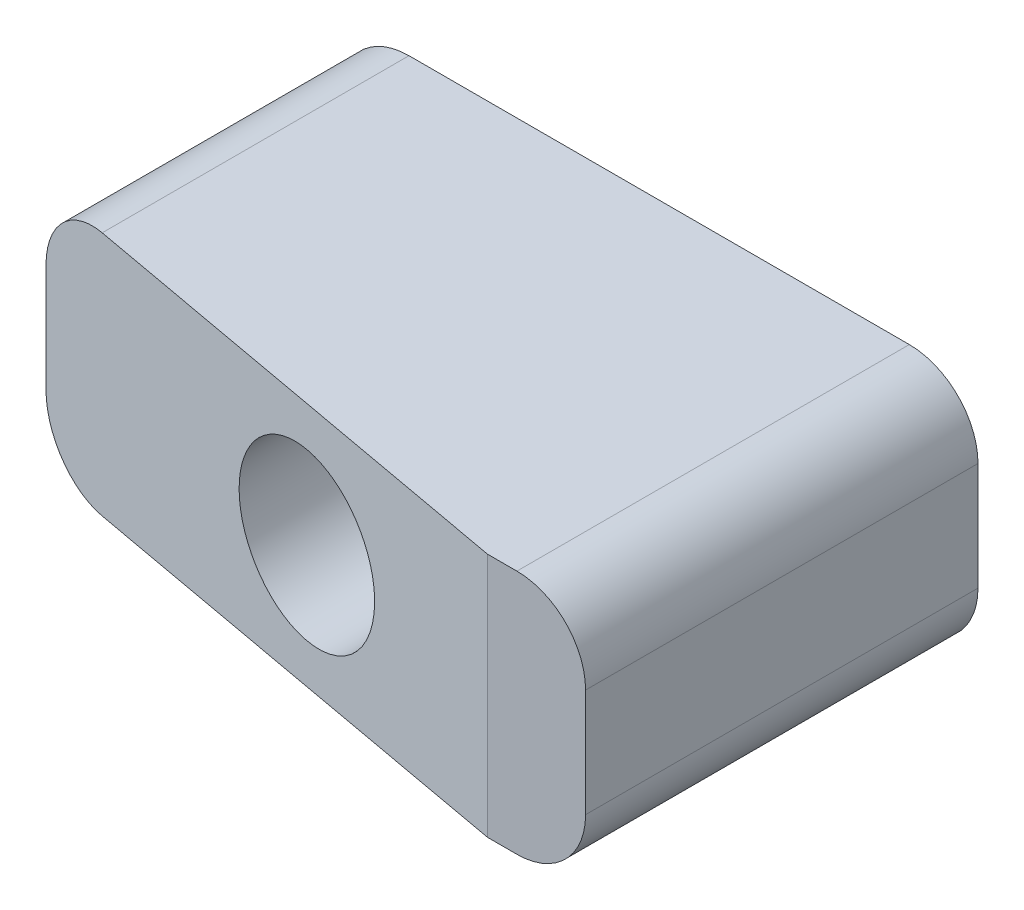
ISO-10303-21;
HEADER;
FILE_DESCRIPTION(('STEP AP214'),'2;1');
FILE_NAME('part.step','',(''),(''),'','','');
FILE_SCHEMA(('AUTOMOTIVE_DESIGN { 1 0 10303 214 1 1 1 1 }'));
ENDSEC;
DATA;
#1=APPLICATION_CONTEXT('core data for automotive mechanical design processes');
#2=APPLICATION_PROTOCOL_DEFINITION('international standard','automotive_design',2000,#1);
#3=PRODUCT_CONTEXT('',#1,'mechanical');
#4=PRODUCT('Part','Part','',(#3));
#5=PRODUCT_RELATED_PRODUCT_CATEGORY('part','',(#4));
#6=PRODUCT_DEFINITION_FORMATION('','',#4);
#7=PRODUCT_DEFINITION_CONTEXT('part definition',#1,'design');
#8=PRODUCT_DEFINITION('design','',#6,#7);
#9=PRODUCT_DEFINITION_SHAPE('','',#8);
#10=(LENGTH_UNIT() NAMED_UNIT(*) SI_UNIT(.MILLI.,.METRE.));
#11=(NAMED_UNIT(*) PLANE_ANGLE_UNIT() SI_UNIT($,.RADIAN.));
#12=(NAMED_UNIT(*) SI_UNIT($,.STERADIAN.) SOLID_ANGLE_UNIT());
#13=UNCERTAINTY_MEASURE_WITH_UNIT(LENGTH_MEASURE(1.E-05),#10,'distance_accuracy_value','');
#14=(GEOMETRIC_REPRESENTATION_CONTEXT(3) GLOBAL_UNCERTAINTY_ASSIGNED_CONTEXT((#13)) GLOBAL_UNIT_ASSIGNED_CONTEXT((#10,
#11,#12)) REPRESENTATION_CONTEXT('',''));
#15=CARTESIAN_POINT('',(0.,0.,0.));
#16=DIRECTION('',(0.,0.,1.));
#17=DIRECTION('',(1.,0.,0.));
#18=AXIS2_PLACEMENT_3D('',#15,#16,#17);
#19=CARTESIAN_POINT('',(-1103.249,76.835,-31.75));
#20=DIRECTION('',(-1.,0.,0.));
#21=DIRECTION('',(0.,0.,1.));
#22=AXIS2_PLACEMENT_3D('',#19,#20,#21);
#23=PLANE('',#22);
#24=DIRECTION('',(0.,0.,1.));
#25=VECTOR('',#24,1.);
#26=CARTESIAN_POINT('',(-1103.249,69.85,-31.75));
#27=LINE('',#26,#25);
#28=CARTESIAN_POINT('',(-1103.249,69.85,-25.4));
#29=VERTEX_POINT('',#28);
#30=CARTESIAN_POINT('',(-1103.249,69.85,-6.34999999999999));
#31=VERTEX_POINT('',#30);
#32=EDGE_CURVE('E190',#29,#31,#27,.T.);
#33=ORIENTED_EDGE('',*,*,#32,.T.);
#34=DIRECTION('',(0.,1.,0.));
#35=VECTOR('',#34,1.);
#36=CARTESIAN_POINT('',(-1103.249,-22.4886369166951,-6.35));
#37=LINE('',#36,#35);
#38=CARTESIAN_POINT('',(-1103.249,76.835,-6.34999999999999));
#39=VERTEX_POINT('',#38);
#40=EDGE_CURVE('E69',#31,#39,#37,.T.);
#41=ORIENTED_EDGE('',*,*,#40,.T.);
#42=DIRECTION('',(0.,0.,1.));
#43=VECTOR('',#42,1.);
#44=CARTESIAN_POINT('',(-1103.249,76.835,-31.75));
#45=LINE('',#44,#43);
#46=CARTESIAN_POINT('',(-1103.249,76.835,-25.4));
#47=VERTEX_POINT('',#46);
#48=EDGE_CURVE('E193',#47,#39,#45,.T.);
#49=ORIENTED_EDGE('',*,*,#48,.F.);
#50=DIRECTION('',(0.,-1.,0.));
#51=VECTOR('',#50,1.);
#52=CARTESIAN_POINT('',(-1103.249,76.835,-25.4));
#53=LINE('',#52,#51);
#54=EDGE_CURVE('E381',#47,#29,#53,.T.);
#55=ORIENTED_EDGE('',*,*,#54,.T.);
#56=EDGE_LOOP('',(#33,#41,#49,#55));
#57=FACE_BOUND('',#56,.T.);
#58=ADVANCED_FACE('F49',(#57),#23,.T.);
#59=CARTESIAN_POINT('',(-1098.804,76.835,-31.75));
#60=DIRECTION('',(0.,0.,1.));
#61=DIRECTION('',(1.,0.,0.));
#62=AXIS2_PLACEMENT_3D('',#59,#60,#61);
#63=CYLINDRICAL_SURFACE('',#62,4.44500000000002);
#64=CARTESIAN_POINT('',(-1098.804,76.835,-5.54181818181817));
#65=DIRECTION('',(0.178885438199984,0.,-0.983869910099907));
#66=DIRECTION('',(0.983869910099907,0.,0.178885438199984));
#67=AXIS2_PLACEMENT_3D('',#64,#65,#66);
#68=ELLIPSE('',#67,4.51787370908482,4.44500000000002);
#69=CARTESIAN_POINT('',(-1098.804,81.28,-5.54181818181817));
#70=VERTEX_POINT('',#69);
#71=EDGE_CURVE('E126',#70,#39,#68,.F.);
#72=ORIENTED_EDGE('',*,*,#71,.F.);
#73=DIRECTION('',(0.,0.,1.));
#74=VECTOR('',#73,1.);
#75=CARTESIAN_POINT('',(-1098.804,81.28,-31.75));
#76=LINE('',#75,#74);
#77=CARTESIAN_POINT('',(-1098.804,81.28,-25.4));
#78=VERTEX_POINT('',#77);
#79=EDGE_CURVE('E60',#78,#70,#76,.T.);
#80=ORIENTED_EDGE('',*,*,#79,.F.);
#81=CARTESIAN_POINT('',(-1098.804,76.835,-25.4));
#82=DIRECTION('',(0.,0.,1.));
#83=DIRECTION('',(1.,0.,0.));
#84=AXIS2_PLACEMENT_3D('',#81,#82,#83);
#85=CIRCLE('',#84,4.44500000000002);
#86=EDGE_CURVE('E139',#78,#47,#85,.T.);
#87=ORIENTED_EDGE('',*,*,#86,.T.);
#88=ORIENTED_EDGE('',*,*,#48,.T.);
#89=EDGE_LOOP('',(#72,#80,#87,#88));
#90=FACE_BOUND('',#89,.T.);
#91=ADVANCED_FACE('F259',(#90),#63,.T.);
#92=CARTESIAN_POINT('',(-1066.419,81.28,-31.75));
#93=DIRECTION('',(0.,1.,0.));
#94=DIRECTION('',(0.,0.,1.));
#95=AXIS2_PLACEMENT_3D('',#92,#93,#94);
#96=PLANE('',#95);
#97=DIRECTION('',(-0.983869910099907,0.,-0.178885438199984));
#98=VECTOR('',#97,1.);
#99=CARTESIAN_POINT('',(-1072.06796,81.28,-0.680719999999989));
#100=LINE('',#99,#98);
#101=CARTESIAN_POINT('',(-1068.324,81.28,0.));
#102=VERTEX_POINT('',#101);
#103=EDGE_CURVE('E118',#102,#70,#100,.T.);
#104=ORIENTED_EDGE('',*,*,#103,.F.);
#105=DIRECTION('',(-1.,0.,0.));
#106=VECTOR('',#105,1.);
#107=CARTESIAN_POINT('',(-1066.419,81.28,0.));
#108=LINE('',#107,#106);
#109=CARTESIAN_POINT('',(-1066.419,81.28,0.));
#110=VERTEX_POINT('',#109);
#111=EDGE_CURVE('E121',#110,#102,#108,.T.);
#112=ORIENTED_EDGE('',*,*,#111,.F.);
#113=DIRECTION('',(0.,0.,1.));
#114=VECTOR('',#113,1.);
#115=CARTESIAN_POINT('',(-1066.419,81.28,-31.75));
#116=LINE('',#115,#114);
#117=CARTESIAN_POINT('',(-1066.419,81.28,-25.4));
#118=VERTEX_POINT('',#117);
#119=EDGE_CURVE('E99',#118,#110,#116,.T.);
#120=ORIENTED_EDGE('',*,*,#119,.F.);
#121=DIRECTION('',(-1.,0.,0.));
#122=VECTOR('',#121,1.);
#123=CARTESIAN_POINT('',(-1098.804,81.28,-25.4));
#124=LINE('',#123,#122);
#125=EDGE_CURVE('E53',#118,#78,#124,.T.);
#126=ORIENTED_EDGE('',*,*,#125,.T.);
#127=ORIENTED_EDGE('',*,*,#79,.T.);
#128=EDGE_LOOP('',(#104,#112,#120,#126,#127));
#129=FACE_BOUND('',#128,.T.);
#130=ADVANCED_FACE('F120',(#129),#96,.T.);
#131=CARTESIAN_POINT('',(-1066.419,76.835,-31.75));
#132=DIRECTION('',(0.,0.,1.));
#133=DIRECTION('',(1.,0.,0.));
#134=AXIS2_PLACEMENT_3D('',#131,#132,#133);
#135=CYLINDRICAL_SURFACE('',#134,4.44500000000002);
#136=CARTESIAN_POINT('',(-1066.419,76.835,0.));
#137=DIRECTION('',(0.,0.,1.));
#138=DIRECTION('',(-1.,0.,0.));
#139=AXIS2_PLACEMENT_3D('',#136,#137,#138);
#140=CIRCLE('',#139,4.44500000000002);
#141=CARTESIAN_POINT('',(-1061.974,76.835,0.));
#142=VERTEX_POINT('',#141);
#143=EDGE_CURVE('E137',#142,#110,#140,.T.);
#144=ORIENTED_EDGE('',*,*,#143,.F.);
#145=DIRECTION('',(0.,0.,1.));
#146=VECTOR('',#145,1.);
#147=CARTESIAN_POINT('',(-1061.974,76.835,-31.75));
#148=LINE('',#147,#146);
#149=CARTESIAN_POINT('',(-1061.974,76.835,-25.4));
#150=VERTEX_POINT('',#149);
#151=EDGE_CURVE('E175',#150,#142,#148,.T.);
#152=ORIENTED_EDGE('',*,*,#151,.F.);
#153=CARTESIAN_POINT('',(-1066.419,76.835,-25.4));
#154=DIRECTION('',(0.,0.,1.));
#155=DIRECTION('',(1.,0.,0.));
#156=AXIS2_PLACEMENT_3D('',#153,#154,#155);
#157=CIRCLE('',#156,4.44500000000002);
#158=EDGE_CURVE('E384',#150,#118,#157,.T.);
#159=ORIENTED_EDGE('',*,*,#158,.T.);
#160=ORIENTED_EDGE('',*,*,#119,.T.);
#161=EDGE_LOOP('',(#144,#152,#159,#160));
#162=FACE_BOUND('',#161,.T.);
#163=ADVANCED_FACE('F279',(#162),#135,.T.);
#164=CARTESIAN_POINT('',(-1061.974,76.835,-31.75));
#165=DIRECTION('',(1.,0.,0.));
#166=DIRECTION('',(0.,0.,-1.));
#167=AXIS2_PLACEMENT_3D('',#164,#165,#166);
#168=PLANE('',#167);
#169=DIRECTION('',(0.,1.,0.));
#170=VECTOR('',#169,1.);
#171=CARTESIAN_POINT('',(-1061.974,76.835,0.));
#172=LINE('',#171,#170);
#173=CARTESIAN_POINT('',(-1061.974,69.85,0.));
#174=VERTEX_POINT('',#173);
#175=EDGE_CURVE('E166',#174,#142,#172,.T.);
#176=ORIENTED_EDGE('',*,*,#175,.F.);
#177=DIRECTION('',(0.,0.,1.));
#178=VECTOR('',#177,1.);
#179=CARTESIAN_POINT('',(-1061.974,69.85,-31.75));
#180=LINE('',#179,#178);
#181=CARTESIAN_POINT('',(-1061.974,69.85,-25.4));
#182=VERTEX_POINT('',#181);
#183=EDGE_CURVE('E179',#182,#174,#180,.T.);
#184=ORIENTED_EDGE('',*,*,#183,.F.);
#185=DIRECTION('',(0.,1.,0.));
#186=VECTOR('',#185,1.);
#187=CARTESIAN_POINT('',(-1061.974,76.835,-25.4));
#188=LINE('',#187,#186);
#189=EDGE_CURVE('E387',#182,#150,#188,.T.);
#190=ORIENTED_EDGE('',*,*,#189,.T.);
#191=ORIENTED_EDGE('',*,*,#151,.T.);
#192=EDGE_LOOP('',(#176,#184,#190,#191));
#193=FACE_BOUND('',#192,.T.);
#194=ADVANCED_FACE('F275',(#193),#168,.T.);
#195=CARTESIAN_POINT('',(-1066.419,69.85,-31.75));
#196=DIRECTION('',(0.,0.,1.));
#197=DIRECTION('',(1.,0.,0.));
#198=AXIS2_PLACEMENT_3D('',#195,#196,#197);
#199=CYLINDRICAL_SURFACE('',#198,4.44500000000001);
#200=CARTESIAN_POINT('',(-1066.419,69.85,0.));
#201=DIRECTION('',(0.,0.,1.));
#202=DIRECTION('',(-1.,0.,0.));
#203=AXIS2_PLACEMENT_3D('',#200,#201,#202);
#204=CIRCLE('',#203,4.44500000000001);
#205=CARTESIAN_POINT('',(-1066.419,65.405,0.));
#206=VERTEX_POINT('',#205);
#207=EDGE_CURVE('E162',#206,#174,#204,.T.);
#208=ORIENTED_EDGE('',*,*,#207,.F.);
#209=DIRECTION('',(0.,0.,1.));
#210=VECTOR('',#209,1.);
#211=CARTESIAN_POINT('',(-1066.419,65.405,-31.75));
#212=LINE('',#211,#210);
#213=CARTESIAN_POINT('',(-1066.419,65.405,-25.4));
#214=VERTEX_POINT('',#213);
#215=EDGE_CURVE('E183',#214,#206,#212,.T.);
#216=ORIENTED_EDGE('',*,*,#215,.F.);
#217=CARTESIAN_POINT('',(-1066.419,69.85,-25.4));
#218=DIRECTION('',(0.,0.,1.));
#219=DIRECTION('',(1.,0.,0.));
#220=AXIS2_PLACEMENT_3D('',#217,#218,#219);
#221=CIRCLE('',#220,4.44500000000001);
#222=EDGE_CURVE('E391',#214,#182,#221,.T.);
#223=ORIENTED_EDGE('',*,*,#222,.T.);
#224=ORIENTED_EDGE('',*,*,#183,.T.);
#225=EDGE_LOOP('',(#208,#216,#223,#224));
#226=FACE_BOUND('',#225,.T.);
#227=ADVANCED_FACE('F271',(#226),#199,.T.);
#228=CARTESIAN_POINT('',(-1066.419,65.405,-31.75));
#229=DIRECTION('',(0.,-1.,0.));
#230=DIRECTION('',(1.,0.,0.));
#231=AXIS2_PLACEMENT_3D('',#228,#229,#230);
#232=PLANE('',#231);
#233=DIRECTION('',(0.983869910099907,0.,0.178885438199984));
#234=VECTOR('',#233,1.);
#235=CARTESIAN_POINT('',(-1072.06796,65.405,-0.680719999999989));
#236=LINE('',#235,#234);
#237=CARTESIAN_POINT('',(-1098.804,65.405,-5.54181818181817));
#238=VERTEX_POINT('',#237);
#239=CARTESIAN_POINT('',(-1068.324,65.405,0.));
#240=VERTEX_POINT('',#239);
#241=EDGE_CURVE('E127',#238,#240,#236,.T.);
#242=ORIENTED_EDGE('',*,*,#241,.F.);
#243=DIRECTION('',(0.,0.,1.));
#244=VECTOR('',#243,1.);
#245=CARTESIAN_POINT('',(-1098.804,65.405,-31.75));
#246=LINE('',#245,#244);
#247=CARTESIAN_POINT('',(-1098.804,65.405,-25.4));
#248=VERTEX_POINT('',#247);
#249=EDGE_CURVE('E187',#248,#238,#246,.T.);
#250=ORIENTED_EDGE('',*,*,#249,.F.);
#251=DIRECTION('',(1.,0.,0.));
#252=VECTOR('',#251,1.);
#253=CARTESIAN_POINT('',(-1098.804,65.405,-25.4));
#254=LINE('',#253,#252);
#255=EDGE_CURVE('E397',#248,#214,#254,.T.);
#256=ORIENTED_EDGE('',*,*,#255,.T.);
#257=ORIENTED_EDGE('',*,*,#215,.T.);
#258=DIRECTION('',(1.,0.,0.));
#259=VECTOR('',#258,1.);
#260=CARTESIAN_POINT('',(-1066.419,65.405,0.));
#261=LINE('',#260,#259);
#262=EDGE_CURVE('E159',#240,#206,#261,.T.);
#263=ORIENTED_EDGE('',*,*,#262,.F.);
#264=EDGE_LOOP('',(#242,#250,#256,#257,#263));
#265=FACE_BOUND('',#264,.T.);
#266=ADVANCED_FACE('F268',(#265),#232,.T.);
#267=CARTESIAN_POINT('',(-1098.804,69.85,-31.75));
#268=DIRECTION('',(0.,0.,1.));
#269=DIRECTION('',(1.,0.,0.));
#270=AXIS2_PLACEMENT_3D('',#267,#268,#269);
#271=CYLINDRICAL_SURFACE('',#270,4.44500000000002);
#272=CARTESIAN_POINT('',(-1098.804,69.85,-5.54181818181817));
#273=DIRECTION('',(0.178885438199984,0.,-0.983869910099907));
#274=DIRECTION('',(0.983869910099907,0.,0.178885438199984));
#275=AXIS2_PLACEMENT_3D('',#272,#273,#274);
#276=ELLIPSE('',#275,4.51787370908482,4.44500000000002);
#277=EDGE_CURVE('E13',#31,#238,#276,.F.);
#278=ORIENTED_EDGE('',*,*,#277,.F.);
#279=ORIENTED_EDGE('',*,*,#32,.F.);
#280=CARTESIAN_POINT('',(-1098.804,69.85,-25.4));
#281=DIRECTION('',(0.,0.,1.));
#282=DIRECTION('',(1.,0.,0.));
#283=AXIS2_PLACEMENT_3D('',#280,#281,#282);
#284=CIRCLE('',#283,4.44500000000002);
#285=EDGE_CURVE('E401',#29,#248,#284,.T.);
#286=ORIENTED_EDGE('',*,*,#285,.T.);
#287=ORIENTED_EDGE('',*,*,#249,.T.);
#288=EDGE_LOOP('',(#278,#279,#286,#287));
#289=FACE_BOUND('',#288,.T.);
#290=ADVANCED_FACE('F265',(#289),#271,.T.);
#291=CARTESIAN_POINT('',(-1098.804,76.835,-25.4));
#292=DIRECTION('',(0.,0.,1.));
#293=DIRECTION('',(1.,0.,0.));
#294=AXIS2_PLACEMENT_3D('',#291,#292,#293);
#295=PLANE('',#294);
#296=CARTESIAN_POINT('',(-1082.6115,73.3425,-25.4));
#297=DIRECTION('',(0.,0.,1.));
#298=DIRECTION('',(1.,0.,0.));
#299=AXIS2_PLACEMENT_3D('',#296,#297,#298);
#300=CIRCLE('',#299,3.56869999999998);
#301=CARTESIAN_POINT('',(-1079.0428,73.3425,-25.4));
#302=VERTEX_POINT('',#301);
#303=EDGE_CURVE('E152',#302,#302,#300,.T.);
#304=ORIENTED_EDGE('',*,*,#303,.T.);
#305=EDGE_LOOP('',(#304));
#306=FACE_BOUND('',#305,.T.);
#307=ORIENTED_EDGE('',*,*,#86,.F.);
#308=ORIENTED_EDGE('',*,*,#125,.F.);
#309=ORIENTED_EDGE('',*,*,#158,.F.);
#310=ORIENTED_EDGE('',*,*,#189,.F.);
#311=ORIENTED_EDGE('',*,*,#222,.F.);
#312=ORIENTED_EDGE('',*,*,#255,.F.);
#313=ORIENTED_EDGE('',*,*,#285,.F.);
#314=ORIENTED_EDGE('',*,*,#54,.F.);
#315=EDGE_LOOP('',(#307,#308,#309,#310,#311,#312,#313,#314));
#316=FACE_BOUND('',#315,.T.);
#317=ADVANCED_FACE('F51',(#306,#316),#295,.F.);
#318=CARTESIAN_POINT('',(-1098.804,76.835,0.));
#319=DIRECTION('',(0.,0.,1.));
#320=DIRECTION('',(1.,0.,0.));
#321=AXIS2_PLACEMENT_3D('',#318,#319,#320);
#322=PLANE('',#321);
#323=DIRECTION('',(0.,1.,0.));
#324=VECTOR('',#323,1.);
#325=CARTESIAN_POINT('',(-1068.324,-22.4886369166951,0.));
#326=LINE('',#325,#324);
#327=EDGE_CURVE('E133',#240,#102,#326,.T.);
#328=ORIENTED_EDGE('',*,*,#327,.F.);
#329=ORIENTED_EDGE('',*,*,#262,.T.);
#330=ORIENTED_EDGE('',*,*,#207,.T.);
#331=ORIENTED_EDGE('',*,*,#175,.T.);
#332=ORIENTED_EDGE('',*,*,#143,.T.);
#333=ORIENTED_EDGE('',*,*,#111,.T.);
#334=EDGE_LOOP('',(#328,#329,#330,#331,#332,#333));
#335=FACE_BOUND('',#334,.T.);
#336=ADVANCED_FACE('F131',(#335),#322,.T.);
#337=CARTESIAN_POINT('',(-1068.324,-22.4886369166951,0.));
#338=DIRECTION('',(0.178885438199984,0.,-0.983869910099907));
#339=DIRECTION('',(-0.983869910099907,0.,-0.178885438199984));
#340=AXIS2_PLACEMENT_3D('',#337,#338,#339);
#341=PLANE('',#340);
#342=CARTESIAN_POINT('',(-1082.6115,73.3425,-2.59772727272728));
#343=DIRECTION('',(0.178885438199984,0.,-0.983869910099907));
#344=DIRECTION('',(0.983869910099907,0.,0.178885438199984));
#345=AXIS2_PLACEMENT_3D('',#342,#343,#344);
#346=ELLIPSE('',#345,5.44726487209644,5.3593999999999);
#347=CARTESIAN_POINT('',(-1077.2521,73.3425,-1.62329090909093));
#348=VERTEX_POINT('',#347);
#349=EDGE_CURVE('E145',#348,#348,#346,.T.);
#350=ORIENTED_EDGE('',*,*,#349,.T.);
#351=EDGE_LOOP('',(#350));
#352=FACE_BOUND('',#351,.T.);
#353=ORIENTED_EDGE('',*,*,#103,.T.);
#354=ORIENTED_EDGE('',*,*,#71,.T.);
#355=ORIENTED_EDGE('',*,*,#40,.F.);
#356=ORIENTED_EDGE('',*,*,#277,.T.);
#357=ORIENTED_EDGE('',*,*,#241,.T.);
#358=ORIENTED_EDGE('',*,*,#327,.T.);
#359=EDGE_LOOP('',(#353,#354,#355,#356,#357,#358));
#360=FACE_BOUND('',#359,.T.);
#361=ADVANCED_FACE('F142',(#352,#360),#341,.F.);
#362=CARTESIAN_POINT('',(-1082.6115,73.3425,0.));
#363=DIRECTION('',(0.,0.,1.));
#364=DIRECTION('',(1.,0.,0.));
#365=AXIS2_PLACEMENT_3D('',#362,#363,#364);
#366=CYLINDRICAL_SURFACE('',#365,5.3593999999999);
#367=CARTESIAN_POINT('',(-1082.6115,73.3425,-19.05));
#368=DIRECTION('',(0.,0.,1.));
#369=DIRECTION('',(1.,0.,0.));
#370=AXIS2_PLACEMENT_3D('',#367,#368,#369);
#371=CIRCLE('',#370,5.3593999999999);
#372=CARTESIAN_POINT('',(-1077.2521,73.3425,-19.05));
#373=VERTEX_POINT('',#372);
#374=EDGE_CURVE('E227',#373,#373,#371,.T.);
#375=ORIENTED_EDGE('',*,*,#374,.F.);
#376=EDGE_LOOP('',(#375));
#377=FACE_BOUND('',#376,.T.);
#378=ORIENTED_EDGE('',*,*,#349,.F.);
#379=EDGE_LOOP('',(#378));
#380=FACE_BOUND('',#379,.T.);
#381=ADVANCED_FACE('F244',(#377,#380),#366,.F.);
#382=CARTESIAN_POINT('',(-1082.6115,73.3425,0.));
#383=DIRECTION('',(0.,0.,1.));
#384=DIRECTION('',(1.,0.,0.));
#385=AXIS2_PLACEMENT_3D('',#382,#383,#384);
#386=CYLINDRICAL_SURFACE('',#385,3.56869999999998);
#387=ORIENTED_EDGE('',*,*,#303,.F.);
#388=EDGE_LOOP('',(#387));
#389=FACE_BOUND('',#388,.T.);
#390=CARTESIAN_POINT('',(-1082.6115,73.3425,-19.05));
#391=DIRECTION('',(0.,0.,1.));
#392=DIRECTION('',(1.,0.,0.));
#393=AXIS2_PLACEMENT_3D('',#390,#391,#392);
#394=CIRCLE('',#393,3.56869999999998);
#395=CARTESIAN_POINT('',(-1079.0428,73.3425,-19.05));
#396=VERTEX_POINT('',#395);
#397=EDGE_CURVE('E222',#396,#396,#394,.T.);
#398=ORIENTED_EDGE('',*,*,#397,.T.);
#399=EDGE_LOOP('',(#398));
#400=FACE_BOUND('',#399,.T.);
#401=ADVANCED_FACE('F247',(#389,#400),#386,.F.);
#402=CARTESIAN_POINT('',(-1079.0428,73.3425,-19.05));
#403=DIRECTION('',(0.,0.,-1.));
#404=DIRECTION('',(-1.,0.,0.));
#405=AXIS2_PLACEMENT_3D('',#402,#403,#404);
#406=PLANE('',#405);
#407=ORIENTED_EDGE('',*,*,#397,.F.);
#408=EDGE_LOOP('',(#407));
#409=FACE_BOUND('',#408,.T.);
#410=ORIENTED_EDGE('',*,*,#374,.T.);
#411=EDGE_LOOP('',(#410));
#412=FACE_BOUND('',#411,.T.);
#413=ADVANCED_FACE('F242',(#409,#412),#406,.F.);
#414=CLOSED_SHELL('',(#58,#91,#130,#163,#194,#227,#266,#290,#317,#336,#361,#381,#401,#413));
#415=MANIFOLD_SOLID_BREP('B2',#414);
#416=ADVANCED_BREP_SHAPE_REPRESENTATION('',(#18,#415),#14);
#417=SHAPE_DEFINITION_REPRESENTATION(#9,#416);
ENDSEC;
END-ISO-10303-21;
